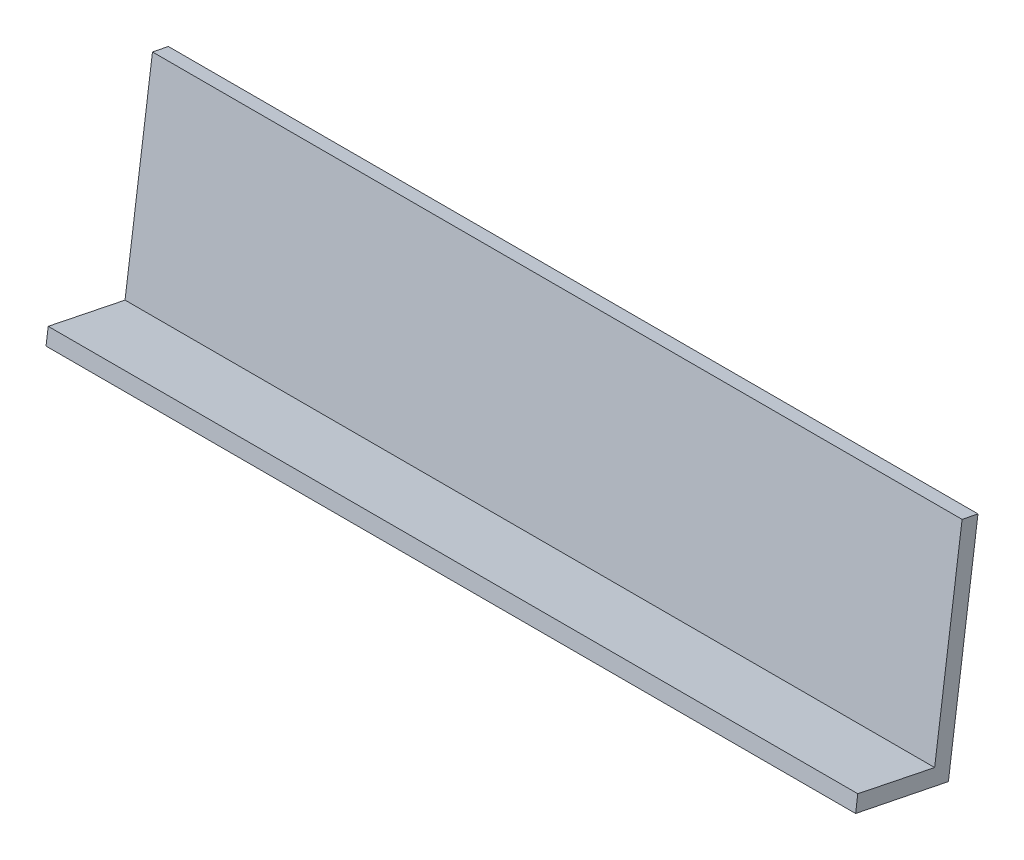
from build123d import *

# Parameters (mm, degrees)
RESSALTO_EXTRUS_O3_DEPTH = 600


with BuildPart() as part:
    # Esbo_o3 → Ressalto-extrus_o3 (new body)
    with BuildSketch(Plane(origin=(0, 0, 0), x_dir=(0, 0, -1), z_dir=(1, 0, 0))):
        Polygon((10.183377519, -164.12732876), (32.131791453, -3.28782488), (20.345624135, -0.905851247), (0, -150), (-56.947402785, -138.347362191), (-58.569265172, -150.232482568), align=None)
    extrude(amount=RESSALTO_EXTRUS_O3_DEPTH)


solid = part.part
